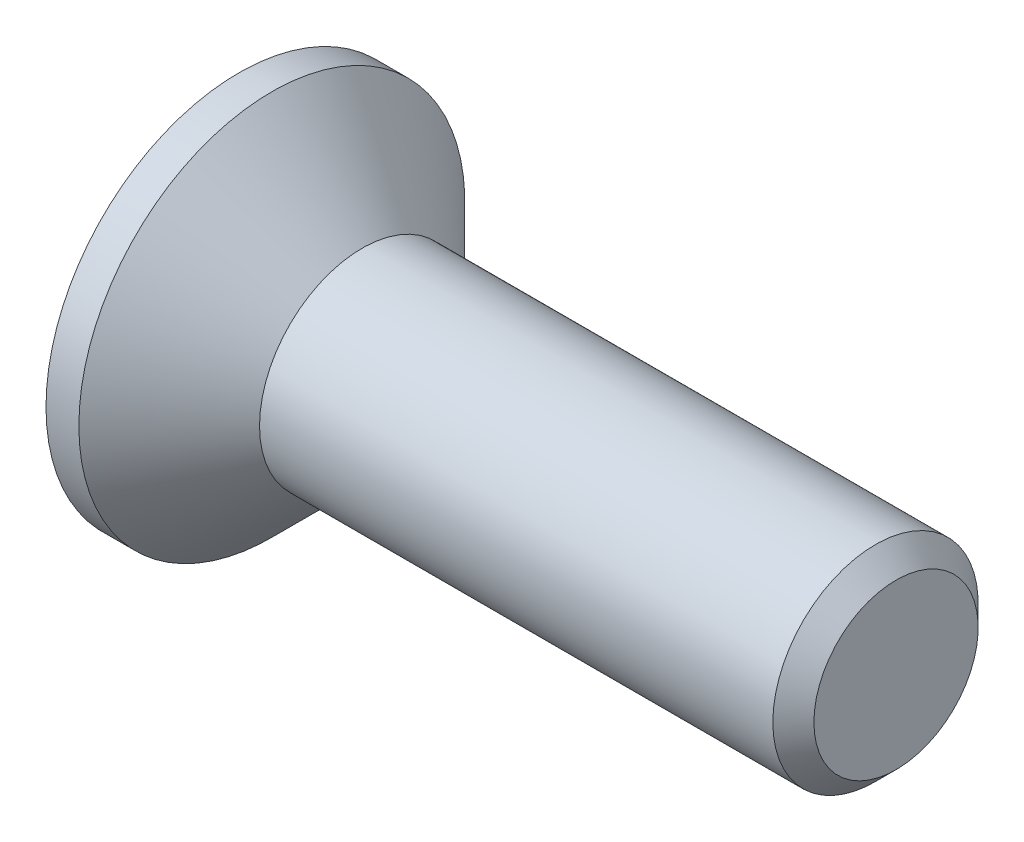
from build123d import *

# Parameters (mm, degrees)
CHAMFER1_SIZE      = 0.25
CUT_EXTRUDE1_DEPTH = 1.25


with BuildPart() as part:
    # Sketch1 → Revolve1 (revolve)
    with BuildSketch(Plane.XY, mode=Mode.PRIVATE) as revolve1_sk:
        Polygon((-1.5, 2.35), (-1.5, 0), (6.5, 0), (6.5, 1.25), (0, 1.25), (-1.1, 2.35), align=None)
    revolve(revolve1_sk.sketch.rotate(Axis((-1.5, 0, 0), (1, 0, 0)), 90), axis=Axis((-1.5, 0, 0), (1, 0, 0)))

    # Chamfer1
    chamfer1_edges = [part.edges().sort_by_distance(p)[0] for p in [
        (6.5, 0, -1.25),
    ]]
    chamfer(chamfer1_edges, length=CHAMFER1_SIZE)

    # Sketch2 → Cut-Extrude1 (cut)
    with BuildSketch(Plane.ZY.offset(1.5)):
        Polygon((-0.34, 1.35), (0.34, 1.35), (0.34, 0.34), (1.35, 0.34), (1.35, -0.34), (0.34, -0.34), (0.34, -1.35), (-0.34, -1.35), (-0.34, -0.34), (-1.35, -0.34), (-1.35, 0.34), (-0.34, 0.34), align=None)
    extrude(amount=-CUT_EXTRUDE1_DEPTH, mode=Mode.SUBTRACT)


solid = part.part
